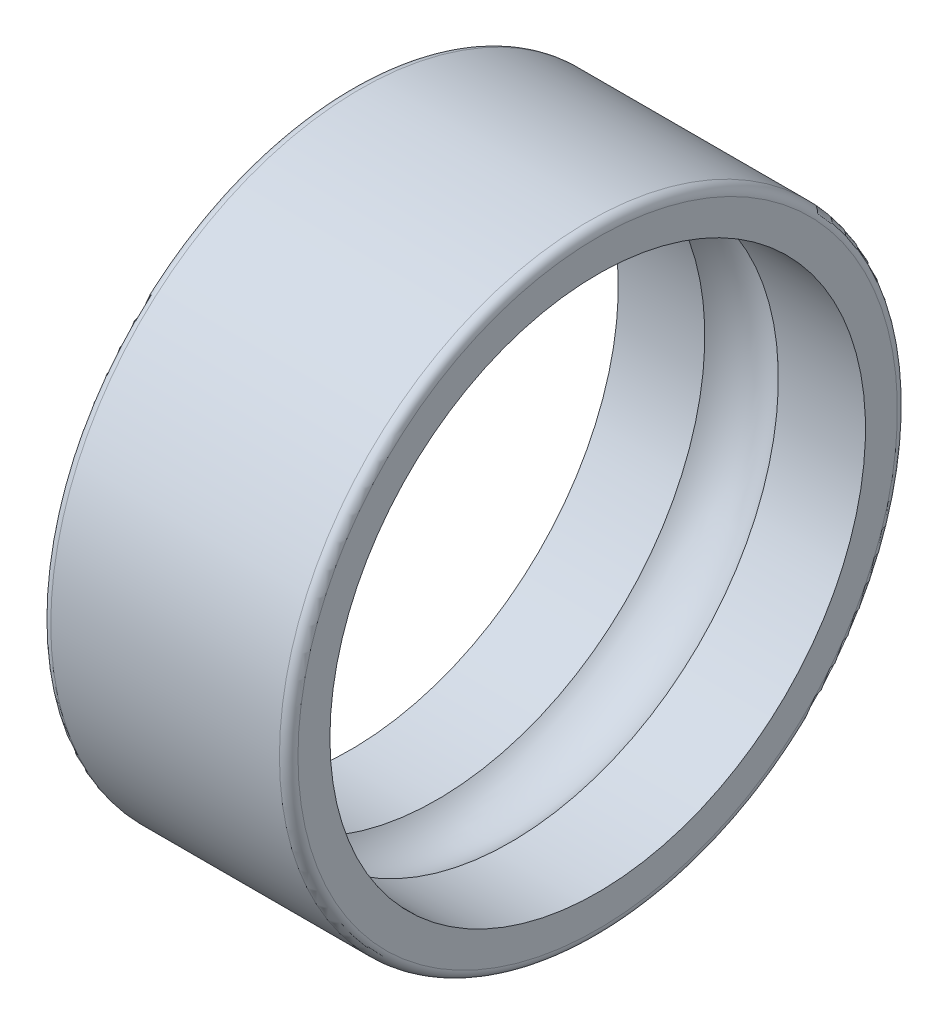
ISO-10303-21;
HEADER;
FILE_DESCRIPTION(('STEP AP214'),'2;1');
FILE_NAME('part.step','',(''),(''),'','','');
FILE_SCHEMA(('AUTOMOTIVE_DESIGN { 1 0 10303 214 1 1 1 1 }'));
ENDSEC;
DATA;
#1=APPLICATION_CONTEXT('core data for automotive mechanical design processes');
#2=APPLICATION_PROTOCOL_DEFINITION('international standard','automotive_design',2000,#1);
#3=PRODUCT_CONTEXT('',#1,'mechanical');
#4=PRODUCT('Part','Part','',(#3));
#5=PRODUCT_RELATED_PRODUCT_CATEGORY('part','',(#4));
#6=PRODUCT_DEFINITION_FORMATION('','',#4);
#7=PRODUCT_DEFINITION_CONTEXT('part definition',#1,'design');
#8=PRODUCT_DEFINITION('design','',#6,#7);
#9=PRODUCT_DEFINITION_SHAPE('','',#8);
#10=(LENGTH_UNIT() NAMED_UNIT(*) SI_UNIT(.MILLI.,.METRE.));
#11=(NAMED_UNIT(*) PLANE_ANGLE_UNIT() SI_UNIT($,.RADIAN.));
#12=(NAMED_UNIT(*) SI_UNIT($,.STERADIAN.) SOLID_ANGLE_UNIT());
#13=UNCERTAINTY_MEASURE_WITH_UNIT(LENGTH_MEASURE(1.E-05),#10,'distance_accuracy_value','');
#14=(GEOMETRIC_REPRESENTATION_CONTEXT(3) GLOBAL_UNCERTAINTY_ASSIGNED_CONTEXT((#13)) GLOBAL_UNIT_ASSIGNED_CONTEXT((#10,
#11,#12)) REPRESENTATION_CONTEXT('',''));
#15=CARTESIAN_POINT('',(0.,0.,0.));
#16=DIRECTION('',(0.,0.,1.));
#17=DIRECTION('',(1.,0.,0.));
#18=AXIS2_PLACEMENT_3D('',#15,#16,#17);
#19=CARTESIAN_POINT('',(3.5048809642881,4.85,0.));
#20=DIRECTION('',(1.,0.,0.));
#21=DIRECTION('',(0.,0.,-1.));
#22=AXIS2_PLACEMENT_3D('',#19,#20,#21);
#23=PLANE('',#22);
#24=CARTESIAN_POINT('',(3.5048809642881,0.,0.));
#25=DIRECTION('',(-1.,0.,0.));
#26=DIRECTION('',(0.,0.,1.));
#27=AXIS2_PLACEMENT_3D('',#24,#25,#26);
#28=CIRCLE('',#27,4.33333333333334);
#29=CARTESIAN_POINT('',(3.5048809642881,0.,4.33333333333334));
#30=VERTEX_POINT('',#29);
#31=EDGE_CURVE('E58',#30,#30,#28,.T.);
#32=ORIENTED_EDGE('',*,*,#31,.T.);
#33=EDGE_LOOP('',(#32));
#34=FACE_BOUND('',#33,.T.);
#35=CARTESIAN_POINT('',(3.5048809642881,0.,0.));
#36=DIRECTION('',(-1.,0.,0.));
#37=DIRECTION('',(0.,0.,1.));
#38=AXIS2_PLACEMENT_3D('',#35,#36,#37);
#39=CIRCLE('',#38,4.85);
#40=CARTESIAN_POINT('',(3.5048809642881,0.,4.85));
#41=VERTEX_POINT('',#40);
#42=EDGE_CURVE('E10',#41,#41,#39,.T.);
#43=ORIENTED_EDGE('',*,*,#42,.F.);
#44=EDGE_LOOP('',(#43));
#45=FACE_BOUND('',#44,.T.);
#46=ADVANCED_FACE('F30',(#34,#45),#23,.T.);
#47=CARTESIAN_POINT('',(3.3548809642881,0.,0.));
#48=DIRECTION('',(-1.,0.,0.));
#49=DIRECTION('',(0.,0.,1.));
#50=AXIS2_PLACEMENT_3D('',#47,#48,#49);
#51=TOROIDAL_SURFACE('',#50,4.85,0.15);
#52=ORIENTED_EDGE('',*,*,#42,.T.);
#53=EDGE_LOOP('',(#52));
#54=FACE_BOUND('',#53,.T.);
#55=CARTESIAN_POINT('',(3.3548809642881,0.,0.));
#56=DIRECTION('',(-1.,0.,0.));
#57=DIRECTION('',(0.,0.,1.));
#58=AXIS2_PLACEMENT_3D('',#55,#56,#57);
#59=CIRCLE('',#58,5.);
#60=CARTESIAN_POINT('',(3.3548809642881,0.,5.));
#61=VERTEX_POINT('',#60);
#62=EDGE_CURVE('E36',#61,#61,#59,.T.);
#63=ORIENTED_EDGE('',*,*,#62,.F.);
#64=EDGE_LOOP('',(#63));
#65=FACE_BOUND('',#64,.T.);
#66=ADVANCED_FACE('F76',(#54,#65),#51,.T.);
#67=CARTESIAN_POINT('',(3.,0.,0.));
#68=DIRECTION('',(-1.,0.,0.));
#69=DIRECTION('',(0.,0.,1.));
#70=AXIS2_PLACEMENT_3D('',#67,#68,#69);
#71=CYLINDRICAL_SURFACE('',#70,5.);
#72=ORIENTED_EDGE('',*,*,#62,.T.);
#73=EDGE_LOOP('',(#72));
#74=FACE_BOUND('',#73,.T.);
#75=CARTESIAN_POINT('',(-0.345119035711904,0.,0.));
#76=DIRECTION('',(-1.,0.,0.));
#77=DIRECTION('',(0.,0.,1.));
#78=AXIS2_PLACEMENT_3D('',#75,#76,#77);
#79=CIRCLE('',#78,5.);
#80=CARTESIAN_POINT('',(-0.345119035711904,0.,5.));
#81=VERTEX_POINT('',#80);
#82=EDGE_CURVE('E40',#81,#81,#79,.T.);
#83=ORIENTED_EDGE('',*,*,#82,.F.);
#84=EDGE_LOOP('',(#83));
#85=FACE_BOUND('',#84,.T.);
#86=ADVANCED_FACE('F80',(#74,#85),#71,.T.);
#87=CARTESIAN_POINT('',(-0.345119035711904,0.,0.));
#88=DIRECTION('',(-1.,0.,0.));
#89=DIRECTION('',(0.,0.,1.));
#90=AXIS2_PLACEMENT_3D('',#87,#88,#89);
#91=TOROIDAL_SURFACE('',#90,4.85,0.15);
#92=ORIENTED_EDGE('',*,*,#82,.T.);
#93=EDGE_LOOP('',(#92));
#94=FACE_BOUND('',#93,.T.);
#95=CARTESIAN_POINT('',(-0.495119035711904,0.,0.));
#96=DIRECTION('',(-1.,0.,0.));
#97=DIRECTION('',(0.,0.,1.));
#98=AXIS2_PLACEMENT_3D('',#95,#96,#97);
#99=CIRCLE('',#98,4.85);
#100=CARTESIAN_POINT('',(-0.495119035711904,0.,4.85));
#101=VERTEX_POINT('',#100);
#102=EDGE_CURVE('E44',#101,#101,#99,.T.);
#103=ORIENTED_EDGE('',*,*,#102,.F.);
#104=EDGE_LOOP('',(#103));
#105=FACE_BOUND('',#104,.T.);
#106=ADVANCED_FACE('F84',(#94,#105),#91,.T.);
#107=CARTESIAN_POINT('',(-0.495119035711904,4.33333333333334,0.));
#108=DIRECTION('',(-1.,0.,0.));
#109=DIRECTION('',(0.,0.,1.));
#110=AXIS2_PLACEMENT_3D('',#107,#108,#109);
#111=PLANE('',#110);
#112=ORIENTED_EDGE('',*,*,#102,.T.);
#113=EDGE_LOOP('',(#112));
#114=FACE_BOUND('',#113,.T.);
#115=CARTESIAN_POINT('',(-0.495119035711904,0.,0.));
#116=DIRECTION('',(-1.,0.,0.));
#117=DIRECTION('',(0.,0.,1.));
#118=AXIS2_PLACEMENT_3D('',#115,#116,#117);
#119=CIRCLE('',#118,4.33333333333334);
#120=CARTESIAN_POINT('',(-0.495119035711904,0.,4.33333333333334));
#121=VERTEX_POINT('',#120);
#122=EDGE_CURVE('E49',#121,#121,#119,.T.);
#123=ORIENTED_EDGE('',*,*,#122,.F.);
#124=EDGE_LOOP('',(#123));
#125=FACE_BOUND('',#124,.T.);
#126=ADVANCED_FACE('F90',(#114,#125),#111,.T.);
#127=CARTESIAN_POINT('',(3.,0.,0.));
#128=DIRECTION('',(-1.,0.,0.));
#129=DIRECTION('',(0.,0.,1.));
#130=AXIS2_PLACEMENT_3D('',#127,#128,#129);
#131=CYLINDRICAL_SURFACE('',#130,4.33333333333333);
#132=ORIENTED_EDGE('',*,*,#122,.T.);
#133=EDGE_LOOP('',(#132));
#134=FACE_BOUND('',#133,.T.);
#135=CARTESIAN_POINT('',(0.904880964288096,0.,0.));
#136=DIRECTION('',(-1.,0.,0.));
#137=DIRECTION('',(0.,0.,1.));
#138=AXIS2_PLACEMENT_3D('',#135,#136,#137);
#139=CIRCLE('',#138,4.33333333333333);
#140=CARTESIAN_POINT('',(0.904880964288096,0.,4.33333333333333));
#141=VERTEX_POINT('',#140);
#142=EDGE_CURVE('E52',#141,#141,#139,.T.);
#143=ORIENTED_EDGE('',*,*,#142,.F.);
#144=EDGE_LOOP('',(#143));
#145=FACE_BOUND('',#144,.T.);
#146=ADVANCED_FACE('F72',(#134,#145),#131,.F.);
#147=CARTESIAN_POINT('',(1.5,0.,0.));
#148=DIRECTION('',(-1.,0.,0.));
#149=DIRECTION('',(0.,0.,1.));
#150=AXIS2_PLACEMENT_3D('',#147,#148,#149);
#151=TOROIDAL_SURFACE('',#150,3.75,0.833333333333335);
#152=ORIENTED_EDGE('',*,*,#142,.T.);
#153=EDGE_LOOP('',(#152));
#154=FACE_BOUND('',#153,.T.);
#155=CARTESIAN_POINT('',(2.0951190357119,0.,0.));
#156=DIRECTION('',(-1.,0.,0.));
#157=DIRECTION('',(0.,0.,1.));
#158=AXIS2_PLACEMENT_3D('',#155,#156,#157);
#159=CIRCLE('',#158,4.33333333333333);
#160=CARTESIAN_POINT('',(2.0951190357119,0.,4.33333333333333));
#161=VERTEX_POINT('',#160);
#162=EDGE_CURVE('E55',#161,#161,#159,.T.);
#163=ORIENTED_EDGE('',*,*,#162,.F.);
#164=EDGE_LOOP('',(#163));
#165=FACE_BOUND('',#164,.T.);
#166=ADVANCED_FACE('F66',(#154,#165),#151,.F.);
#167=CARTESIAN_POINT('',(3.,0.,0.));
#168=DIRECTION('',(-1.,0.,0.));
#169=DIRECTION('',(0.,0.,1.));
#170=AXIS2_PLACEMENT_3D('',#167,#168,#169);
#171=CYLINDRICAL_SURFACE('',#170,4.33333333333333);
#172=ORIENTED_EDGE('',*,*,#162,.T.);
#173=EDGE_LOOP('',(#172));
#174=FACE_BOUND('',#173,.T.);
#175=ORIENTED_EDGE('',*,*,#31,.F.);
#176=EDGE_LOOP('',(#175));
#177=FACE_BOUND('',#176,.T.);
#178=ADVANCED_FACE('F64',(#174,#177),#171,.F.);
#179=CLOSED_SHELL('',(#46,#66,#86,#106,#126,#146,#166,#178));
#180=MANIFOLD_SOLID_BREP('B2',#179);
#181=ADVANCED_BREP_SHAPE_REPRESENTATION('',(#18,#180),#14);
#182=SHAPE_DEFINITION_REPRESENTATION(#9,#181);
ENDSEC;
END-ISO-10303-21;
